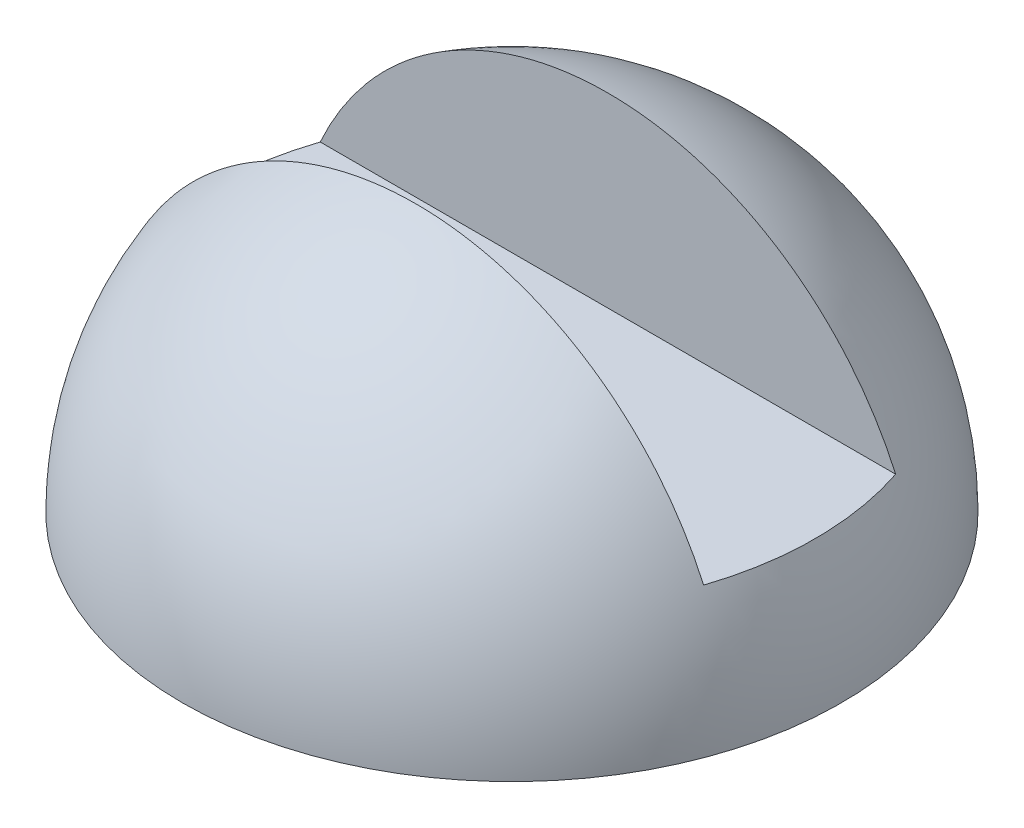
from build123d import *

# Parameters (mm, degrees)
SKETCH_3_W          = 17.517428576
SKETCH_3_H          = 19.51503008
CUT_EXTRUDE_1_DEPTH = 35


with BuildPart() as part:
    # Sketch 1 → Revolve 1 (revolve)
    with BuildSketch(Plane.XY, mode=Mode.PRIVATE) as revolve_1_sk:
        with BuildLine():
            Line((-30.068484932, 0), (0, 0))
            Line((0, 0), (0, 30.068484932))
            ThreePointArc((0, 30.068484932), (-21.261629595, 21.261629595), (-30.068484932, 0))
        make_face()
    revolve(revolve_1_sk.sketch.rotate(Axis((0, 60.137207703, 0), (0, -1, 0)), 180), axis=Axis((0, 60.137207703, 0), (0, -1, 0)))

    # Sketch 3 → Cut-Extrude 1 (cut, symmetric)
    with BuildSketch(Plane(origin=(0, 0, 0), x_dir=(0, 0, -1), z_dir=(1, 0, 0))):
        with Locations((0, 21.526447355)):
            Rectangle(SKETCH_3_W, SKETCH_3_H)
    extrude(amount=CUT_EXTRUDE_1_DEPTH, both=True, mode=Mode.SUBTRACT)


solid = part.part
